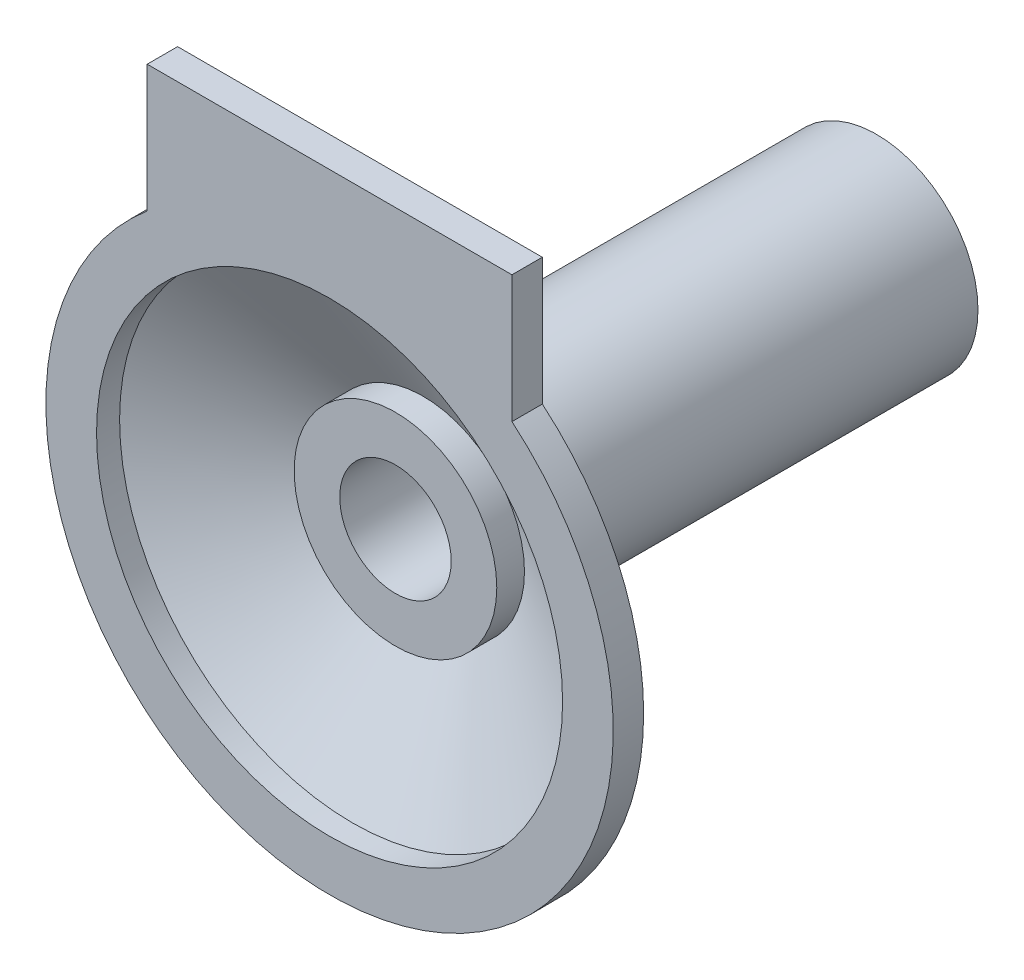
from build123d import *

# Parameters (mm, degrees)
EXTRUDE1_DEPTH = 9.525


with BuildPart() as part:
    # Sketch1 → Revolve1 (revolve)
    with BuildSketch(Plane(origin=(0, 0, 0), x_dir=(0, 0, -1), z_dir=(1, 0, 0)), mode=Mode.PRIVATE) as revolve1_sk:
        Polygon((0, -73.025), (0, -88.9), (9.525, -88.9), (40.141071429, -31.75), (171.45, -31.75), (171.45, -17.4625), (120.65, -17.4625), (120.65, -20.6375), (69.85, -20.6375), (69.85, -17.4625), (20.6502, -17.4625), (20.6502, -31.75), (29.335380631, -31.75), (7.223773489, -73.025), align=None)
    revolve(revolve1_sk.sketch.rotate(Axis((0, 0, 0), (0, 0, -1)), 270), axis=Axis((0, 0, 0), (0, 0, -1)))

    # Sketch2 → Extrude1 (add)
    with BuildSketch(Plane.XY):
        with BuildLine():
            Line((-57.15, 68.096163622), (-26.373530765, 68.096163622))
            ThreePointArc((-26.373530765, 68.096163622), (0, 73.025), (26.373530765, 68.096163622))
            Line((26.373530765, 68.096163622), (57.15, 68.096163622))
            Line((57.15, 68.096163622), (57.15, 107.95))
            Line((57.15, 107.95), (-57.15, 107.95))
            Line((-57.15, 107.95), (-57.15, 68.096163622))
        make_face()
    extrude(amount=-EXTRUDE1_DEPTH)


solid = part.part
